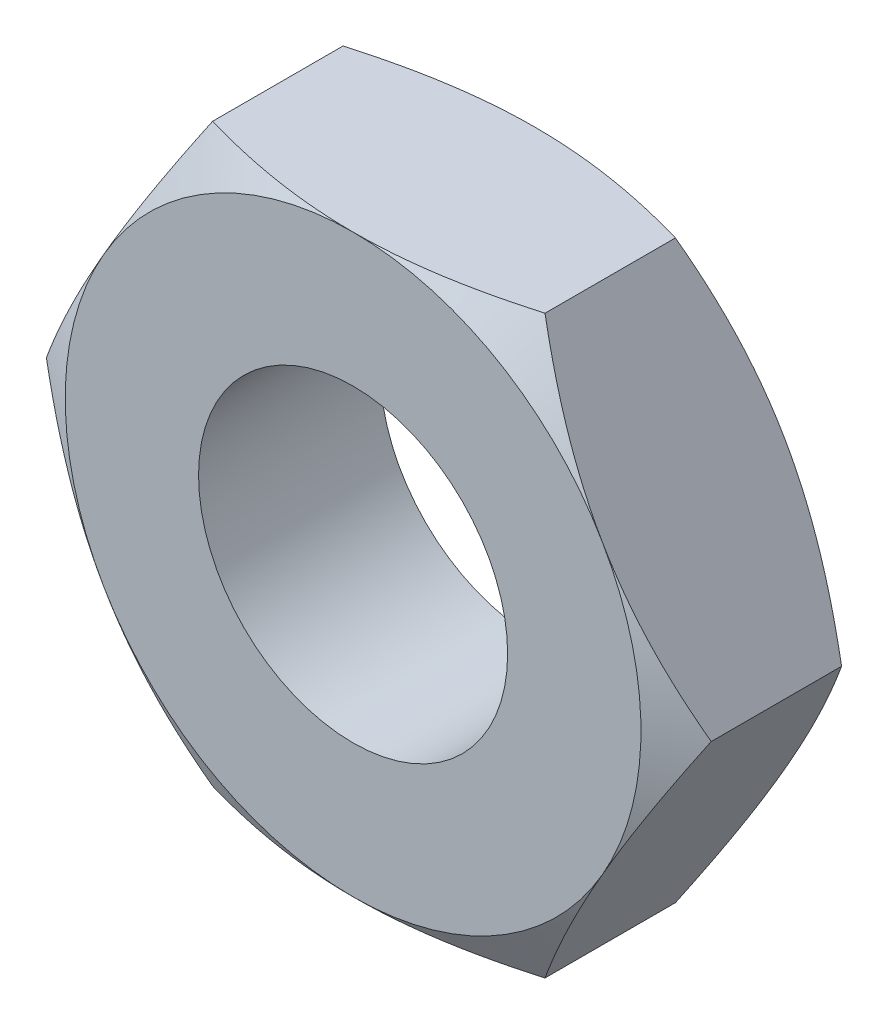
from build123d import *

# Parameters (mm, degrees)
EXTRUDE1_DEPTH = 6
TAPPED_HOLE1_D = 10.2


with BuildPart() as part:
    # Sketch1 → Extrude1 (new body)
    with BuildSketch(Plane.XY):
        Polygon((5.484827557, -9.5), (10.969655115, 0), (5.484827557, 9.5), (-5.484827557, 9.5), (-10.969655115, 0), (-5.484827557, -9.5), align=None)
    extrude(amount=EXTRUDE1_DEPTH)

    # Tapped Hole1 (through all)
    with Locations(Plane.XY.offset(6)):
        with Locations((0, 0)):
            Hole(TAPPED_HOLE1_D / 2)

    # Sketch4 → Cut-Revolve1 (revolve, cut)
    with BuildSketch(Plane(origin=(0, 0, 0), x_dir=(1, 0, 0), z_dir=(0, 1, 0)), mode=Mode.PRIVATE) as cut_revolve1_sk:
        Polygon((-10.969655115, -5.151494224), (-9.5, -6), (-10.969655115, -6), align=None)
        Polygon((-10.969655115, -0.848505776), (-9.5, 0), (-10.969655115, 0), align=None)
    revolve(cut_revolve1_sk.sketch.rotate(Axis((0, 0, 0), (0, 0, 1)), 180), axis=Axis((0, 0, 0), (0, 0, 1)), mode=Mode.SUBTRACT)


solid = part.part
